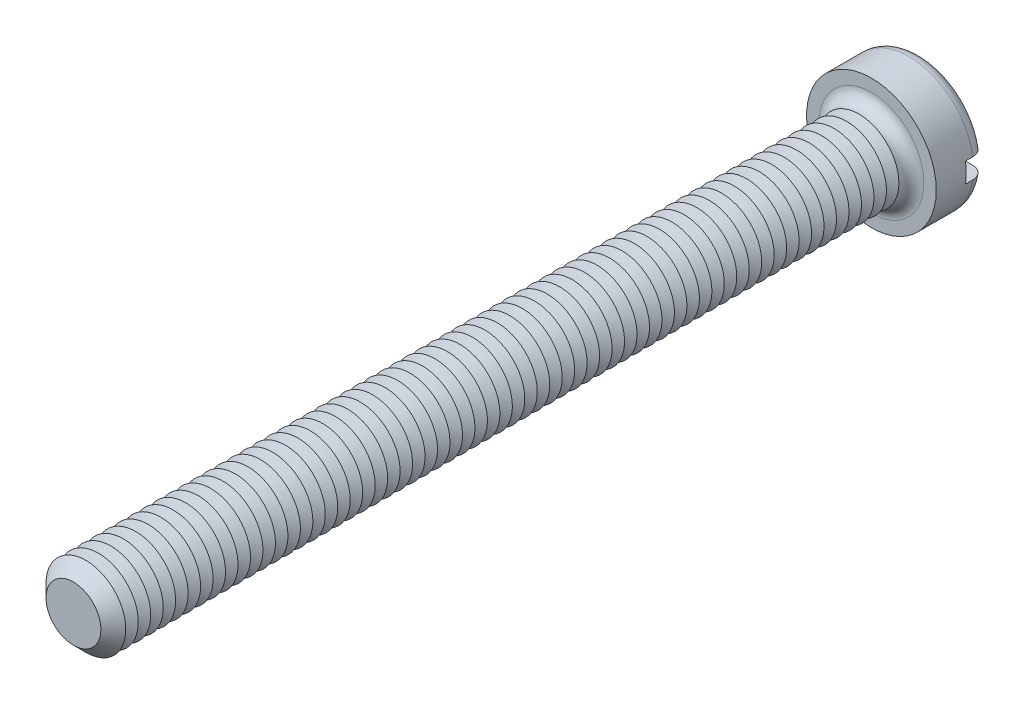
from build123d import *

# Parameters (mm, degrees)
SKETCH3_R           = 6.5
BOSS_EXTRUDE2_DEPTH = 5
SKETCH4_R           = 4
BOSS_EXTRUDE3_DEPTH = 80
FILLET1_R           = 1.25
CHAMFER1_SIZE       = 1.25
LPATTERN1_COUNT     = 62
LPATTERN1_PITCH     = 1.25
SKETCH8_W           = 13
SKETCH8_H           = 2
CUT_EXTRUDE1_DEPTH  = 2


with BuildPart() as part:
    # Sketch3 → Boss-Extrude2 (new body)
    with BuildSketch(Plane.XY):
        Circle(SKETCH3_R)
    extrude(amount=-BOSS_EXTRUDE2_DEPTH)

    # Sketch4 → Boss-Extrude3 (add)
    with BuildSketch(Plane.XY):
        Circle(SKETCH4_R)
    extrude(amount=BOSS_EXTRUDE3_DEPTH)

    # Fillet1
    fillet1_edges = [part.edges().sort_by_distance(p)[0] for p in [
        (-6.5, 0, -5),
        (-4, 0, 0),
    ]]
    fillet(fillet1_edges, radius=FILLET1_R)

    # Chamfer1
    chamfer1_edges = [part.edges().sort_by_distance(p)[0] for p in [
        (-4, 0, 80),
    ]]
    chamfer(chamfer1_edges, length=CHAMFER1_SIZE)

    # Sketch6 → Cut-Revolve1 (revolve, cut)
    with BuildSketch(Plane(origin=(0, 0, 0), x_dir=(0, 0, -1), z_dir=(1, 0, 0)), mode=Mode.PRIVATE) as cut_revolve1_sk:
        Polygon((-1.25, 4), (-1.875, 2.917468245), (-2.5, 4), align=None)
    cut_revolve1 = revolve(cut_revolve1_sk.sketch.rotate(Axis((0, 0, -1.694361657), (0, 0, 1)), 90), axis=Axis((0, 0, -1.694361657), (0, 0, 1)), mode=Mode.SUBTRACT)

    # LPattern1: Cut-Revolve1 ×62
    with Locations(*[(0, 0, i * LPATTERN1_PITCH) for i in range(1, LPATTERN1_COUNT)]):
        add(cut_revolve1, mode=Mode.SUBTRACT)

    # Sketch8 → Cut-Extrude1 (cut)
    with BuildSketch(Plane(origin=(0, 0, -5), x_dir=(-1, 0, 0), z_dir=(0, 0, -1))):
        Rectangle(SKETCH8_W, SKETCH8_H)
    extrude(amount=-CUT_EXTRUDE1_DEPTH, mode=Mode.SUBTRACT)


solid = part.part
